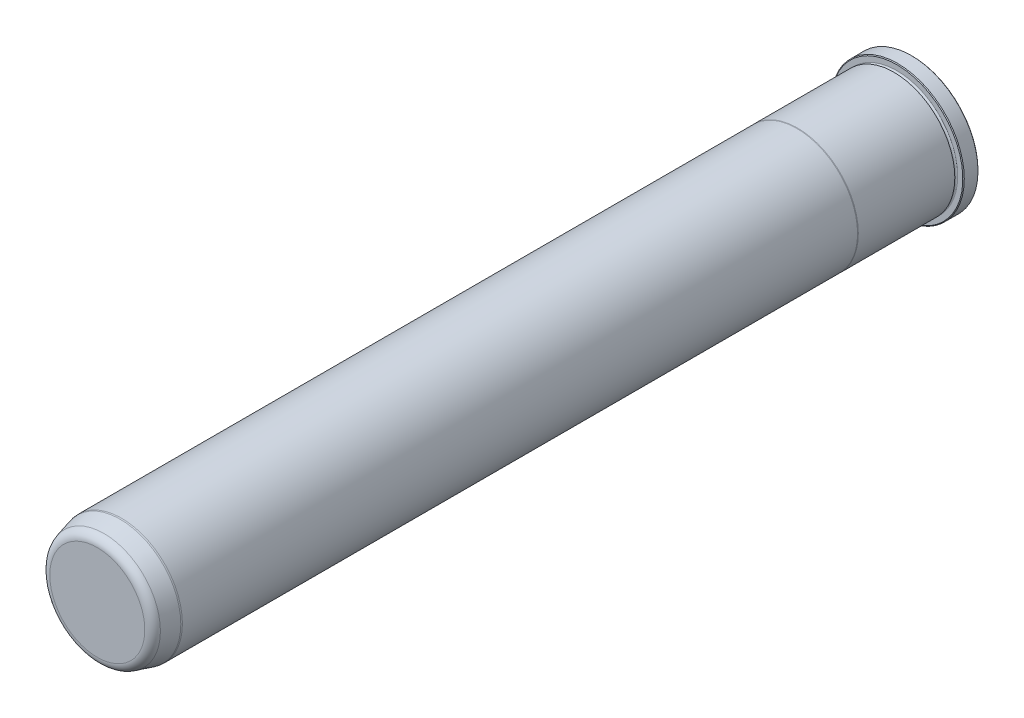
ISO-10303-21;
HEADER;
FILE_DESCRIPTION(('STEP AP214'),'2;1');
FILE_NAME('part.step','',(''),(''),'','','');
FILE_SCHEMA(('AUTOMOTIVE_DESIGN { 1 0 10303 214 1 1 1 1 }'));
ENDSEC;
DATA;
#1=APPLICATION_CONTEXT('core data for automotive mechanical design processes');
#2=APPLICATION_PROTOCOL_DEFINITION('international standard','automotive_design',2000,#1);
#3=PRODUCT_CONTEXT('',#1,'mechanical');
#4=PRODUCT('Part','Part','',(#3));
#5=PRODUCT_RELATED_PRODUCT_CATEGORY('part','',(#4));
#6=PRODUCT_DEFINITION_FORMATION('','',#4);
#7=PRODUCT_DEFINITION_CONTEXT('part definition',#1,'design');
#8=PRODUCT_DEFINITION('design','',#6,#7);
#9=PRODUCT_DEFINITION_SHAPE('','',#8);
#10=(LENGTH_UNIT() NAMED_UNIT(*) SI_UNIT(.MILLI.,.METRE.));
#11=(NAMED_UNIT(*) PLANE_ANGLE_UNIT() SI_UNIT($,.RADIAN.));
#12=(NAMED_UNIT(*) SI_UNIT($,.STERADIAN.) SOLID_ANGLE_UNIT());
#13=UNCERTAINTY_MEASURE_WITH_UNIT(LENGTH_MEASURE(1.E-05),#10,'distance_accuracy_value','');
#14=(GEOMETRIC_REPRESENTATION_CONTEXT(3) GLOBAL_UNCERTAINTY_ASSIGNED_CONTEXT((#13)) GLOBAL_UNIT_ASSIGNED_CONTEXT((#10,
#11,#12)) REPRESENTATION_CONTEXT('',''));
#15=CARTESIAN_POINT('',(0.,0.,0.));
#16=DIRECTION('',(0.,0.,1.));
#17=DIRECTION('',(1.,0.,0.));
#18=AXIS2_PLACEMENT_3D('',#15,#16,#17);
#19=CARTESIAN_POINT('',(0.,0.,0.));
#20=DIRECTION('',(0.,0.,1.));
#21=DIRECTION('',(1.,0.,0.));
#22=AXIS2_PLACEMENT_3D('',#19,#20,#21);
#23=PLANE('',#22);
#24=CARTESIAN_POINT('',(0.,0.,0.));
#25=DIRECTION('',(0.,0.,1.));
#26=DIRECTION('',(1.,0.,0.));
#27=AXIS2_PLACEMENT_3D('',#24,#25,#26);
#28=CIRCLE('',#27,34.417);
#29=CARTESIAN_POINT('',(34.417,0.,0.));
#30=VERTEX_POINT('',#29);
#31=EDGE_CURVE('E37',#30,#30,#28,.F.);
#32=ORIENTED_EDGE('',*,*,#31,.T.);
#33=EDGE_LOOP('',(#32));
#34=FACE_BOUND('',#33,.T.);
#35=ADVANCED_FACE('F30',(#34),#23,.F.);
#36=CARTESIAN_POINT('',(0.,0.,0.));
#37=DIRECTION('',(0.,0.,1.));
#38=DIRECTION('',(1.,0.,0.));
#39=AXIS2_PLACEMENT_3D('',#36,#37,#38);
#40=CYLINDRICAL_SURFACE('',#39,34.798);
#41=CARTESIAN_POINT('',(0.,0.,0.380999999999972));
#42=DIRECTION('',(0.,0.,1.));
#43=DIRECTION('',(1.,0.,0.));
#44=AXIS2_PLACEMENT_3D('',#41,#42,#43);
#45=CIRCLE('',#44,34.798);
#46=CARTESIAN_POINT('',(34.798,0.,0.380999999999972));
#47=VERTEX_POINT('',#46);
#48=EDGE_CURVE('E41',#47,#47,#45,.T.);
#49=ORIENTED_EDGE('',*,*,#48,.T.);
#50=EDGE_LOOP('',(#49));
#51=FACE_BOUND('',#50,.T.);
#52=CARTESIAN_POINT('',(0.,0.,7.54380000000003));
#53=DIRECTION('',(0.,0.,-1.));
#54=DIRECTION('',(-1.,0.,0.));
#55=AXIS2_PLACEMENT_3D('',#52,#53,#54);
#56=CIRCLE('',#55,34.798);
#57=CARTESIAN_POINT('',(-34.798,0.,7.54380000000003));
#58=VERTEX_POINT('',#57);
#59=EDGE_CURVE('E45',#58,#58,#56,.T.);
#60=ORIENTED_EDGE('',*,*,#59,.T.);
#61=EDGE_LOOP('',(#60));
#62=FACE_BOUND('',#61,.T.);
#63=ADVANCED_FACE('F118',(#51,#62),#40,.T.);
#64=CARTESIAN_POINT('',(0.,34.798,7.9248));
#65=DIRECTION('',(0.,0.,-1.));
#66=DIRECTION('',(-1.,0.,0.));
#67=AXIS2_PLACEMENT_3D('',#64,#65,#66);
#68=PLANE('',#67);
#69=CARTESIAN_POINT('',(0.,0.,7.9248));
#70=DIRECTION('',(0.,0.,-1.));
#71=DIRECTION('',(-1.,0.,0.));
#72=AXIS2_PLACEMENT_3D('',#69,#70,#71);
#73=CIRCLE('',#72,34.4170000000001);
#74=CARTESIAN_POINT('',(-34.4170000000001,0.,7.9248));
#75=VERTEX_POINT('',#74);
#76=EDGE_CURVE('E10',#75,#75,#73,.F.);
#77=ORIENTED_EDGE('',*,*,#76,.T.);
#78=EDGE_LOOP('',(#77));
#79=FACE_BOUND('',#78,.T.);
#80=CARTESIAN_POINT('',(0.,0.,7.9248));
#81=DIRECTION('',(0.,0.,1.));
#82=DIRECTION('',(1.,0.,0.));
#83=AXIS2_PLACEMENT_3D('',#80,#81,#82);
#84=CIRCLE('',#83,31.7373);
#85=CARTESIAN_POINT('',(31.7373,0.,7.9248));
#86=VERTEX_POINT('',#85);
#87=EDGE_CURVE('E56',#86,#86,#84,.T.);
#88=ORIENTED_EDGE('',*,*,#87,.F.);
#89=EDGE_LOOP('',(#88));
#90=FACE_BOUND('',#89,.T.);
#91=ADVANCED_FACE('F113',(#79,#90),#68,.F.);
#92=CARTESIAN_POINT('',(0.,0.,8.6868));
#93=DIRECTION('',(0.,0.,1.));
#94=DIRECTION('',(1.,0.,0.));
#95=AXIS2_PLACEMENT_3D('',#92,#93,#94);
#96=TOROIDAL_SURFACE('',#95,31.7373,0.761999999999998);
#97=CARTESIAN_POINT('',(0.,0.,9.44879999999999));
#98=DIRECTION('',(0.,0.,1.));
#99=DIRECTION('',(1.,0.,0.));
#100=AXIS2_PLACEMENT_3D('',#97,#98,#99);
#101=CIRCLE('',#100,31.7373);
#102=CARTESIAN_POINT('',(31.7373,0.,9.44879999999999));
#103=VERTEX_POINT('',#102);
#104=EDGE_CURVE('E59',#103,#103,#101,.T.);
#105=ORIENTED_EDGE('',*,*,#104,.F.);
#106=EDGE_LOOP('',(#105));
#107=FACE_BOUND('',#106,.T.);
#108=ORIENTED_EDGE('',*,*,#87,.T.);
#109=EDGE_LOOP('',(#108));
#110=FACE_BOUND('',#109,.T.);
#111=ADVANCED_FACE('F107',(#107,#110),#96,.F.);
#112=CARTESIAN_POINT('',(0.,31.7373,9.44879999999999));
#113=DIRECTION('',(0.,0.,1.));
#114=DIRECTION('',(1.,0.,0.));
#115=AXIS2_PLACEMENT_3D('',#112,#113,#114);
#116=PLANE('',#115);
#117=CARTESIAN_POINT('',(0.,0.,9.4488));
#118=DIRECTION('',(0.,0.,1.));
#119=DIRECTION('',(1.,0.,0.));
#120=AXIS2_PLACEMENT_3D('',#117,#118,#119);
#121=CIRCLE('',#120,31.7627);
#122=CARTESIAN_POINT('',(31.7627,0.,9.4488));
#123=VERTEX_POINT('',#122);
#124=EDGE_CURVE('E62',#123,#123,#121,.T.);
#125=ORIENTED_EDGE('',*,*,#124,.F.);
#126=EDGE_LOOP('',(#125));
#127=FACE_BOUND('',#126,.T.);
#128=ORIENTED_EDGE('',*,*,#104,.T.);
#129=EDGE_LOOP('',(#128));
#130=FACE_BOUND('',#129,.T.);
#131=ADVANCED_FACE('F101',(#127,#130),#116,.F.);
#132=CARTESIAN_POINT('',(0.,0.,0.));
#133=DIRECTION('',(0.,0.,1.));
#134=DIRECTION('',(1.,0.,0.));
#135=AXIS2_PLACEMENT_3D('',#132,#133,#134);
#136=CYLINDRICAL_SURFACE('',#135,31.7627);
#137=CARTESIAN_POINT('',(0.,0.,59.8347630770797));
#138=DIRECTION('',(0.,0.,1.));
#139=DIRECTION('',(1.,0.,0.));
#140=AXIS2_PLACEMENT_3D('',#137,#138,#139);
#141=CIRCLE('',#140,31.7627);
#142=CARTESIAN_POINT('',(31.7627,0.,59.8347630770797));
#143=VERTEX_POINT('',#142);
#144=EDGE_CURVE('E65',#143,#143,#141,.T.);
#145=ORIENTED_EDGE('',*,*,#144,.F.);
#146=EDGE_LOOP('',(#145));
#147=FACE_BOUND('',#146,.T.);
#148=ORIENTED_EDGE('',*,*,#124,.T.);
#149=EDGE_LOOP('',(#148));
#150=FACE_BOUND('',#149,.T.);
#151=ADVANCED_FACE('F95',(#147,#150),#136,.T.);
#152=CARTESIAN_POINT('',(0.,0.,59.8347630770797));
#153=DIRECTION('',(0.,0.,-1.));
#154=DIRECTION('',(-1.,0.,0.));
#155=AXIS2_PLACEMENT_3D('',#152,#153,#154);
#156=CONICAL_SURFACE('',#155,31.7627,0.0698131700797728);
#157=CARTESIAN_POINT('',(0.,0.,60.198));
#158=DIRECTION('',(0.,0.,1.));
#159=DIRECTION('',(1.,0.,0.));
#160=AXIS2_PLACEMENT_3D('',#157,#158,#159);
#161=CIRCLE('',#160,31.7373);
#162=CARTESIAN_POINT('',(31.7373,0.,60.198));
#163=VERTEX_POINT('',#162);
#164=EDGE_CURVE('E68',#163,#163,#161,.T.);
#165=ORIENTED_EDGE('',*,*,#164,.F.);
#166=EDGE_LOOP('',(#165));
#167=FACE_BOUND('',#166,.T.);
#168=ORIENTED_EDGE('',*,*,#144,.T.);
#169=EDGE_LOOP('',(#168));
#170=FACE_BOUND('',#169,.T.);
#171=ADVANCED_FACE('F89',(#167,#170),#156,.T.);
#172=CARTESIAN_POINT('',(0.,0.,0.));
#173=DIRECTION('',(0.,0.,1.));
#174=DIRECTION('',(1.,0.,0.));
#175=AXIS2_PLACEMENT_3D('',#172,#173,#174);
#176=CYLINDRICAL_SURFACE('',#175,31.7373);
#177=CARTESIAN_POINT('',(0.,0.,412.75));
#178=DIRECTION('',(0.,0.,1.));
#179=DIRECTION('',(1.,0.,0.));
#180=AXIS2_PLACEMENT_3D('',#177,#178,#179);
#181=CIRCLE('',#180,31.7373);
#182=CARTESIAN_POINT('',(31.7373,0.,412.75));
#183=VERTEX_POINT('',#182);
#184=EDGE_CURVE('E71',#183,#183,#181,.T.);
#185=ORIENTED_EDGE('',*,*,#184,.F.);
#186=EDGE_LOOP('',(#185));
#187=FACE_BOUND('',#186,.T.);
#188=ORIENTED_EDGE('',*,*,#164,.T.);
#189=EDGE_LOOP('',(#188));
#190=FACE_BOUND('',#189,.T.);
#191=ADVANCED_FACE('F83',(#187,#190),#176,.T.);
#192=CARTESIAN_POINT('',(0.,0.,412.75));
#193=DIRECTION('',(0.,0.,-1.));
#194=DIRECTION('',(-1.,0.,0.));
#195=AXIS2_PLACEMENT_3D('',#192,#193,#194);
#196=CONICAL_SURFACE('',#195,31.7373,0.0872664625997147);
#197=CARTESIAN_POINT('',(0.,0.,413.512));
#198=DIRECTION('',(0.,0.,1.));
#199=DIRECTION('',(1.,0.,0.));
#200=AXIS2_PLACEMENT_3D('',#197,#198,#199);
#201=CIRCLE('',#200,31.6706336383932);
#202=CARTESIAN_POINT('',(31.6706336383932,0.,413.512));
#203=VERTEX_POINT('',#202);
#204=EDGE_CURVE('E74',#203,#203,#201,.T.);
#205=ORIENTED_EDGE('',*,*,#204,.F.);
#206=EDGE_LOOP('',(#205));
#207=FACE_BOUND('',#206,.T.);
#208=ORIENTED_EDGE('',*,*,#184,.T.);
#209=EDGE_LOOP('',(#208));
#210=FACE_BOUND('',#209,.T.);
#211=ADVANCED_FACE('F80',(#207,#210),#196,.T.);
#212=CARTESIAN_POINT('',(0.,0.,413.512));
#213=DIRECTION('',(0.,0.,-1.));
#214=DIRECTION('',(-1.,0.,0.));
#215=AXIS2_PLACEMENT_3D('',#212,#213,#214);
#216=CONICAL_SURFACE('',#215,31.6706336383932,0.26179938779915);
#217=CARTESIAN_POINT('',(0.,0.,421.920125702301));
#218=DIRECTION('',(0.,0.,1.));
#219=DIRECTION('',(1.,0.,0.));
#220=AXIS2_PLACEMENT_3D('',#217,#218,#219);
#221=CIRCLE('',#220,29.4176831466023);
#222=CARTESIAN_POINT('',(29.4176831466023,0.,421.920125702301));
#223=VERTEX_POINT('',#222);
#224=EDGE_CURVE('E50',#223,#223,#221,.F.);
#225=ORIENTED_EDGE('',*,*,#224,.T.);
#226=EDGE_LOOP('',(#225));
#227=FACE_BOUND('',#226,.T.);
#228=ORIENTED_EDGE('',*,*,#204,.T.);
#229=EDGE_LOOP('',(#228));
#230=FACE_BOUND('',#229,.T.);
#231=ADVANCED_FACE('F78',(#227,#230),#216,.T.);
#232=CARTESIAN_POINT('',(0.,28.4718561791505,425.45));
#233=DIRECTION('',(0.,0.,-1.));
#234=DIRECTION('',(-1.,0.,0.));
#235=AXIS2_PLACEMENT_3D('',#232,#233,#234);
#236=PLANE('',#235);
#237=CARTESIAN_POINT('',(0.,0.,425.45));
#238=DIRECTION('',(0.,0.,-1.));
#239=DIRECTION('',(-1.,0.,0.));
#240=AXIS2_PLACEMENT_3D('',#237,#238,#239);
#241=CIRCLE('',#240,24.8174613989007);
#242=CARTESIAN_POINT('',(-24.8174613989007,0.,425.45));
#243=VERTEX_POINT('',#242);
#244=EDGE_CURVE('E53',#243,#243,#241,.F.);
#245=ORIENTED_EDGE('',*,*,#244,.T.);
#246=EDGE_LOOP('',(#245));
#247=FACE_BOUND('',#246,.T.);
#248=ADVANCED_FACE('F133',(#247),#236,.F.);
#249=CARTESIAN_POINT('',(0.,0.,420.6875));
#250=DIRECTION('',(0.,0.,-1.));
#251=DIRECTION('',(-1.,0.,0.));
#252=AXIS2_PLACEMENT_3D('',#249,#250,#251);
#253=TOROIDAL_SURFACE('',#252,24.8174613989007,4.7625);
#254=ORIENTED_EDGE('',*,*,#224,.F.);
#255=EDGE_LOOP('',(#254));
#256=FACE_BOUND('',#255,.T.);
#257=ORIENTED_EDGE('',*,*,#244,.F.);
#258=EDGE_LOOP('',(#257));
#259=FACE_BOUND('',#258,.T.);
#260=ADVANCED_FACE('F130',(#256,#259),#253,.T.);
#261=CARTESIAN_POINT('',(0.,0.,0.380999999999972));
#262=DIRECTION('',(0.,0.,1.));
#263=DIRECTION('',(1.,0.,0.));
#264=AXIS2_PLACEMENT_3D('',#261,#262,#263);
#265=CONICAL_SURFACE('',#264,34.798,0.785398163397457);
#266=ORIENTED_EDGE('',*,*,#31,.F.);
#267=EDGE_LOOP('',(#266));
#268=FACE_BOUND('',#267,.T.);
#269=ORIENTED_EDGE('',*,*,#48,.F.);
#270=EDGE_LOOP('',(#269));
#271=FACE_BOUND('',#270,.T.);
#272=ADVANCED_FACE('F132',(#268,#271),#265,.T.);
#273=CARTESIAN_POINT('',(0.,0.,7.9248));
#274=DIRECTION('',(0.,0.,-1.));
#275=DIRECTION('',(-1.,0.,0.));
#276=AXIS2_PLACEMENT_3D('',#273,#274,#275);
#277=CONICAL_SURFACE('',#276,34.4170000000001,0.785398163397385);
#278=ORIENTED_EDGE('',*,*,#59,.F.);
#279=EDGE_LOOP('',(#278));
#280=FACE_BOUND('',#279,.T.);
#281=ORIENTED_EDGE('',*,*,#76,.F.);
#282=EDGE_LOOP('',(#281));
#283=FACE_BOUND('',#282,.T.);
#284=ADVANCED_FACE('F32',(#280,#283),#277,.T.);
#285=CLOSED_SHELL('',(#35,#63,#91,#111,#131,#151,#171,#191,#211,#231,#248,#260,#272,#284));
#286=MANIFOLD_SOLID_BREP('B2',#285);
#287=ADVANCED_BREP_SHAPE_REPRESENTATION('',(#18,#286),#14);
#288=SHAPE_DEFINITION_REPRESENTATION(#9,#287);
ENDSEC;
END-ISO-10303-21;
